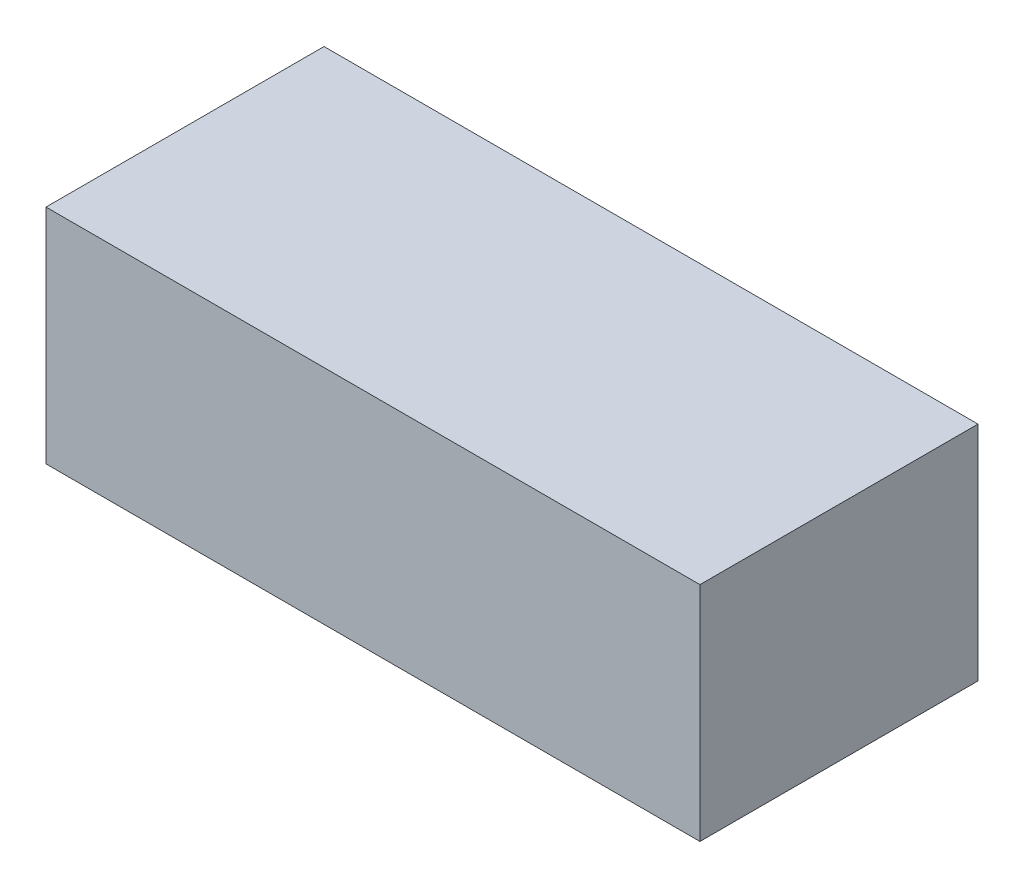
ISO-10303-21;
HEADER;
FILE_DESCRIPTION(('STEP AP214'),'2;1');
FILE_NAME('part.step','',(''),(''),'','','');
FILE_SCHEMA(('AUTOMOTIVE_DESIGN { 1 0 10303 214 1 1 1 1 }'));
ENDSEC;
DATA;
#1=APPLICATION_CONTEXT('core data for automotive mechanical design processes');
#2=APPLICATION_PROTOCOL_DEFINITION('international standard','automotive_design',2000,#1);
#3=PRODUCT_CONTEXT('',#1,'mechanical');
#4=PRODUCT('Part','Part','',(#3));
#5=PRODUCT_RELATED_PRODUCT_CATEGORY('part','',(#4));
#6=PRODUCT_DEFINITION_FORMATION('','',#4);
#7=PRODUCT_DEFINITION_CONTEXT('part definition',#1,'design');
#8=PRODUCT_DEFINITION('design','',#6,#7);
#9=PRODUCT_DEFINITION_SHAPE('','',#8);
#10=(LENGTH_UNIT() NAMED_UNIT(*) SI_UNIT(.MILLI.,.METRE.));
#11=(NAMED_UNIT(*) PLANE_ANGLE_UNIT() SI_UNIT($,.RADIAN.));
#12=(NAMED_UNIT(*) SI_UNIT($,.STERADIAN.) SOLID_ANGLE_UNIT());
#13=UNCERTAINTY_MEASURE_WITH_UNIT(LENGTH_MEASURE(1.E-05),#10,'distance_accuracy_value','');
#14=(GEOMETRIC_REPRESENTATION_CONTEXT(3) GLOBAL_UNCERTAINTY_ASSIGNED_CONTEXT((#13)) GLOBAL_UNIT_ASSIGNED_CONTEXT((#10,
#11,#12)) REPRESENTATION_CONTEXT('',''));
#15=CARTESIAN_POINT('',(0.,0.,0.));
#16=DIRECTION('',(0.,0.,1.));
#17=DIRECTION('',(1.,0.,0.));
#18=AXIS2_PLACEMENT_3D('',#15,#16,#17);
#19=CARTESIAN_POINT('',(-1.47,1.,0.625));
#20=DIRECTION('',(1.,0.,0.));
#21=DIRECTION('',(0.,0.,-1.));
#22=AXIS2_PLACEMENT_3D('',#19,#20,#21);
#23=PLANE('',#22);
#24=DIRECTION('',(0.,0.,1.));
#25=VECTOR('',#24,1.);
#26=CARTESIAN_POINT('',(-1.47,0.,0.625));
#27=LINE('',#26,#25);
#28=CARTESIAN_POINT('',(-1.47,0.,-0.625));
#29=VERTEX_POINT('',#28);
#30=CARTESIAN_POINT('',(-1.47,0.,0.625));
#31=VERTEX_POINT('',#30);
#32=EDGE_CURVE('E95',#29,#31,#27,.T.);
#33=ORIENTED_EDGE('',*,*,#32,.T.);
#34=DIRECTION('',(0.,-1.,0.));
#35=VECTOR('',#34,1.);
#36=CARTESIAN_POINT('',(-1.47,1.,0.625));
#37=LINE('',#36,#35);
#38=CARTESIAN_POINT('',(-1.47,1.,0.625));
#39=VERTEX_POINT('',#38);
#40=EDGE_CURVE('E11',#39,#31,#37,.T.);
#41=ORIENTED_EDGE('',*,*,#40,.F.);
#42=DIRECTION('',(0.,0.,1.));
#43=VECTOR('',#42,1.);
#44=CARTESIAN_POINT('',(-1.47,1.,0.625));
#45=LINE('',#44,#43);
#46=CARTESIAN_POINT('',(-1.47,1.,-0.625));
#47=VERTEX_POINT('',#46);
#48=EDGE_CURVE('E83',#47,#39,#45,.T.);
#49=ORIENTED_EDGE('',*,*,#48,.F.);
#50=DIRECTION('',(0.,-1.,0.));
#51=VECTOR('',#50,1.);
#52=CARTESIAN_POINT('',(-1.47,1.,-0.625));
#53=LINE('',#52,#51);
#54=EDGE_CURVE('E91',#47,#29,#53,.T.);
#55=ORIENTED_EDGE('',*,*,#54,.T.);
#56=EDGE_LOOP('',(#33,#41,#49,#55));
#57=FACE_BOUND('',#56,.T.);
#58=ADVANCED_FACE('F32',(#57),#23,.F.);
#59=CARTESIAN_POINT('',(1.47,1.,0.625));
#60=DIRECTION('',(0.,0.,-1.));
#61=DIRECTION('',(-1.,0.,0.));
#62=AXIS2_PLACEMENT_3D('',#59,#60,#61);
#63=PLANE('',#62);
#64=DIRECTION('',(1.,0.,0.));
#65=VECTOR('',#64,1.);
#66=CARTESIAN_POINT('',(1.47,0.,0.625));
#67=LINE('',#66,#65);
#68=CARTESIAN_POINT('',(1.47,0.,0.625));
#69=VERTEX_POINT('',#68);
#70=EDGE_CURVE('E87',#31,#69,#67,.T.);
#71=ORIENTED_EDGE('',*,*,#70,.T.);
#72=DIRECTION('',(0.,-1.,0.));
#73=VECTOR('',#72,1.);
#74=CARTESIAN_POINT('',(1.47,1.,0.625));
#75=LINE('',#74,#73);
#76=CARTESIAN_POINT('',(1.47,1.,0.625));
#77=VERTEX_POINT('',#76);
#78=EDGE_CURVE('E40',#77,#69,#75,.T.);
#79=ORIENTED_EDGE('',*,*,#78,.F.);
#80=DIRECTION('',(1.,0.,0.));
#81=VECTOR('',#80,1.);
#82=CARTESIAN_POINT('',(1.47,1.,0.625));
#83=LINE('',#82,#81);
#84=EDGE_CURVE('E78',#39,#77,#83,.T.);
#85=ORIENTED_EDGE('',*,*,#84,.F.);
#86=ORIENTED_EDGE('',*,*,#40,.T.);
#87=EDGE_LOOP('',(#71,#79,#85,#86));
#88=FACE_BOUND('',#87,.T.);
#89=ADVANCED_FACE('F86',(#88),#63,.F.);
#90=CARTESIAN_POINT('',(1.47,1.,0.625));
#91=DIRECTION('',(-1.,0.,0.));
#92=DIRECTION('',(0.,0.,1.));
#93=AXIS2_PLACEMENT_3D('',#90,#91,#92);
#94=PLANE('',#93);
#95=DIRECTION('',(0.,0.,-1.));
#96=VECTOR('',#95,1.);
#97=CARTESIAN_POINT('',(1.47,0.,0.625));
#98=LINE('',#97,#96);
#99=CARTESIAN_POINT('',(1.47,0.,-0.625));
#100=VERTEX_POINT('',#99);
#101=EDGE_CURVE('E65',#69,#100,#98,.T.);
#102=ORIENTED_EDGE('',*,*,#101,.T.);
#103=DIRECTION('',(0.,-1.,0.));
#104=VECTOR('',#103,1.);
#105=CARTESIAN_POINT('',(1.47,1.,-0.625));
#106=LINE('',#105,#104);
#107=CARTESIAN_POINT('',(1.47,1.,-0.625));
#108=VERTEX_POINT('',#107);
#109=EDGE_CURVE('E88',#108,#100,#106,.T.);
#110=ORIENTED_EDGE('',*,*,#109,.F.);
#111=DIRECTION('',(0.,0.,-1.));
#112=VECTOR('',#111,1.);
#113=CARTESIAN_POINT('',(1.47,1.,0.625));
#114=LINE('',#113,#112);
#115=EDGE_CURVE('E81',#77,#108,#114,.T.);
#116=ORIENTED_EDGE('',*,*,#115,.F.);
#117=ORIENTED_EDGE('',*,*,#78,.T.);
#118=EDGE_LOOP('',(#102,#110,#116,#117));
#119=FACE_BOUND('',#118,.T.);
#120=ADVANCED_FACE('F89',(#119),#94,.F.);
#121=CARTESIAN_POINT('',(1.47,1.,-0.625));
#122=DIRECTION('',(0.,0.,1.));
#123=DIRECTION('',(1.,0.,0.));
#124=AXIS2_PLACEMENT_3D('',#121,#122,#123);
#125=PLANE('',#124);
#126=DIRECTION('',(-1.,0.,0.));
#127=VECTOR('',#126,1.);
#128=CARTESIAN_POINT('',(1.47,0.,-0.625));
#129=LINE('',#128,#127);
#130=EDGE_CURVE('E71',#100,#29,#129,.T.);
#131=ORIENTED_EDGE('',*,*,#130,.T.);
#132=ORIENTED_EDGE('',*,*,#54,.F.);
#133=DIRECTION('',(-1.,0.,0.));
#134=VECTOR('',#133,1.);
#135=CARTESIAN_POINT('',(1.47,1.,-0.625));
#136=LINE('',#135,#134);
#137=EDGE_CURVE('E48',#108,#47,#136,.T.);
#138=ORIENTED_EDGE('',*,*,#137,.F.);
#139=ORIENTED_EDGE('',*,*,#109,.T.);
#140=EDGE_LOOP('',(#131,#132,#138,#139));
#141=FACE_BOUND('',#140,.T.);
#142=ADVANCED_FACE('F102',(#141),#125,.F.);
#143=CARTESIAN_POINT('',(0.,1.,0.));
#144=DIRECTION('',(0.,1.,0.));
#145=DIRECTION('',(0.,0.,1.));
#146=AXIS2_PLACEMENT_3D('',#143,#144,#145);
#147=PLANE('',#146);
#148=ORIENTED_EDGE('',*,*,#48,.T.);
#149=ORIENTED_EDGE('',*,*,#84,.T.);
#150=ORIENTED_EDGE('',*,*,#115,.T.);
#151=ORIENTED_EDGE('',*,*,#137,.T.);
#152=EDGE_LOOP('',(#148,#149,#150,#151));
#153=FACE_BOUND('',#152,.T.);
#154=ADVANCED_FACE('F79',(#153),#147,.T.);
#155=CARTESIAN_POINT('',(0.,0.,0.));
#156=DIRECTION('',(0.,1.,0.));
#157=DIRECTION('',(0.,0.,1.));
#158=AXIS2_PLACEMENT_3D('',#155,#156,#157);
#159=PLANE('',#158);
#160=ORIENTED_EDGE('',*,*,#32,.F.);
#161=ORIENTED_EDGE('',*,*,#130,.F.);
#162=ORIENTED_EDGE('',*,*,#101,.F.);
#163=ORIENTED_EDGE('',*,*,#70,.F.);
#164=EDGE_LOOP('',(#160,#161,#162,#163));
#165=FACE_BOUND('',#164,.T.);
#166=ADVANCED_FACE('F105',(#165),#159,.F.);
#167=CLOSED_SHELL('',(#58,#89,#120,#142,#154,#166));
#168=MANIFOLD_SOLID_BREP('B2',#167);
#169=ADVANCED_BREP_SHAPE_REPRESENTATION('',(#18,#168),#14);
#170=SHAPE_DEFINITION_REPRESENTATION(#9,#169);
ENDSEC;
END-ISO-10303-21;
